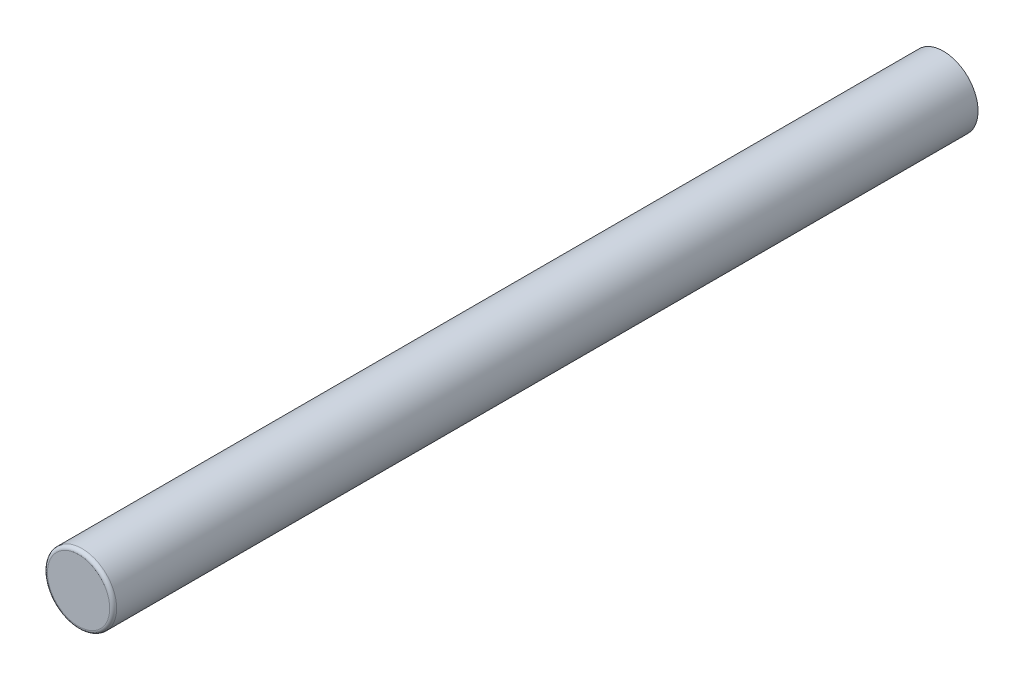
from build123d import *

# Parameters (mm, degrees)
ESQUISSE1_R            = 1
CYLINDRE_DE_BASE_DEPTH = 12.5
CONG_1_R               = 0.1


with BuildPart() as part:
    # Esquisse1 → Cylindre de base (new, symmetric)
    with BuildSketch(Plane.XY):
        with Locations(Location((0, 0, 0), (0, 0, 180))):
            Circle(ESQUISSE1_R)
    extrude(amount=CYLINDRE_DE_BASE_DEPTH, both=True)

    # Cong_1
    cong_1_edges = [part.edges().sort_by_distance(p)[0] for p in [
        (1, 0, 12.5),
    ]]
    fillet(cong_1_edges, radius=CONG_1_R)


solid = part.part
